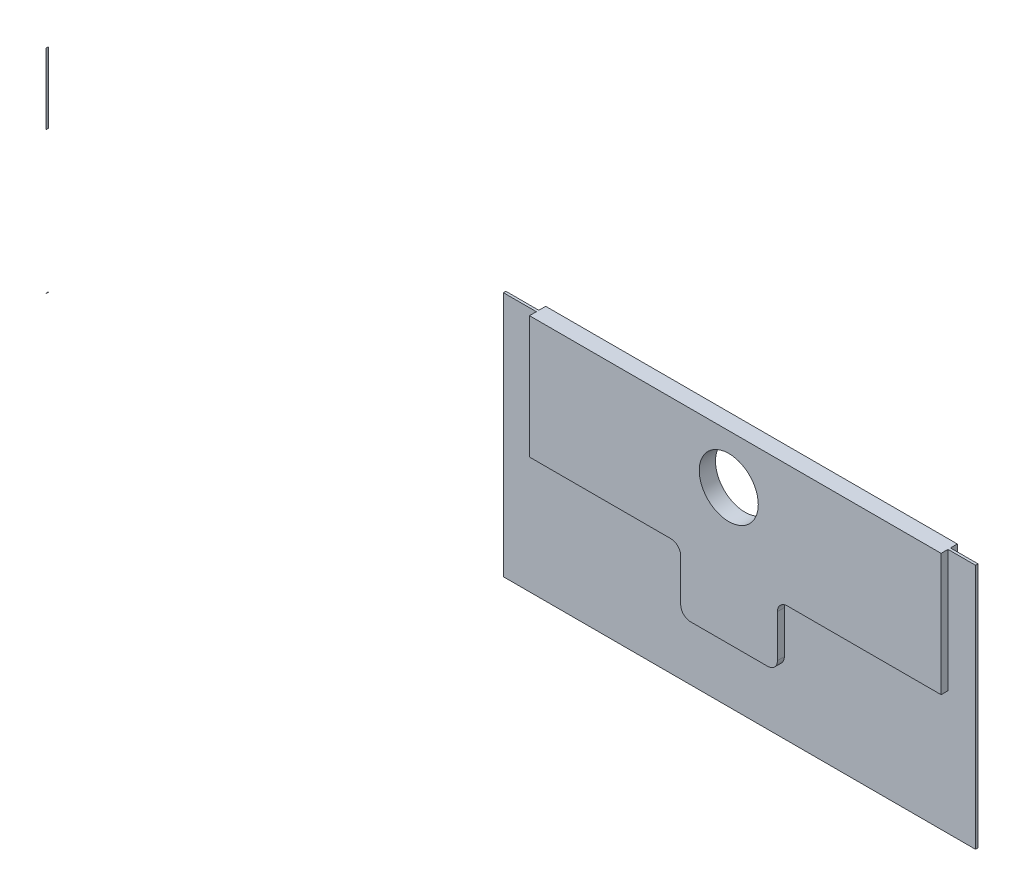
from build123d import *
from build123d.topology import SkipClean

# Parameters (mm, degrees)
SKETCH1_R                = 0.3175
SKETCH1_R_2              = 0.508
SKETCH1_R_3              = 1.524
SKETCH1_R_4              = 3.556
BOSS_EXTRUDE1_DEPTH      = 0.127
BOSS_EXTRUDE2_START      = 0.0508
SKETCH2_R                = 0.6985
SKETCH2_R_2              = 0.3175
BOSS_EXTRUDE2_DEPTH      = 0.0508
SKETCH3_R                = 0.6985
SKETCH3_R_2              = 0.3175
BOSS_EXTRUDE3_DEPTH      = 0.0508
BOSS_EXTRUDE4_START      = 0.0508
SKETCH4_R                = 1.27
SKETCH4_R_2              = 0.508
BOSS_EXTRUDE4_DEPTH      = 0.0508
SKETCH5_R                = 1.27
SKETCH5_R_2              = 0.508
BOSS_EXTRUDE5_DEPTH      = 0.0508
BOSS_EXTRUDE6_DEPTH      = 0.3556
BOSS_EXTRUDE6_DEPTH_BACK = 0.4826
SKETCH6_R                = 3.556
SKETCH6_R_2              = 1.524
BOSS_EXTRUDE8_START      = 0.3556
SKETCH9_R                = 1.524
BOSS_EXTRUDE8_DEPTH      = 0.3556
BOSS_EXTRUDE9_START      = 0.3556
SKETCH10_R               = 1.524
BOSS_EXTRUDE9_DEPTH      = 0.3556
BOSS_EXTRUDE10_START     = 0.3556
SKETCH11_R               = 5.2197
SKETCH11_R_2             = 3.556
SKETCH11_R_3             = 1.524
BOSS_EXTRUDE10_DEPTH     = 0.3556
SKETCH12_W               = 21.2598
SKETCH12_H               = 12.707452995
SKETCH12_R               = 1.524
BOSS_EXTRUDE11_DEPTH     = 0.3556
SKETCH13_W               = 21.2852
SKETCH13_H               = 12.707452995
SKETCH13_R               = 1.524
BOSS_EXTRUDE12_DEPTH     = 0.3556
SKETCH14_R               = 1.778
SKETCH14_R_2             = 1.524
SKETCH14_R_3             = 3.556
SKETCH14_R_4             = 5.2197
BOSS_EXTRUDE13_DEPTH     = 0.3556
BOSS_EXTRUDE17_DEPTH     = 0.0508
SKETCH18_W               = 1.099038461
SKETCH18_H               = 0.529166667
BOSS_EXTRUDE19_DEPTH     = 0.0508
SKETCH19_W               = 23.622
SKETCH19_H               = 19.360223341
CUT_EXTRUDE2_DEPTH       = 384.062358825
SKETCH19_2_W             = 23.622
SKETCH19_2_H             = 19.360223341
CUT_EXTRUDE3_DEPTH       = 2.54
SKETCH20_W               = 76.5741445
SKETCH20_H               = 30.113427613
CUT_EXTRUDE4_DEPTH       = 2.54


with BuildPart() as part:
    # Sketch1 → Boss-Extrude1 (new body)
    with BuildSketch(Plane.XY.offset(0.39116)):
        Polygon((156.11155468, 251.50762754), (156.337, 251.47794764), (256.286000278, 251.47794764), (256.286000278, 251.48474214), (256.491552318, 251.45768098), (256.683098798, 251.378339), (256.847581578, 251.25212894), (256.973791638, 251.08764616), (257.053133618, 250.89609968), (257.080194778, 250.69054764), (257.073399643, 247.66794764), (257.062440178, 247.66794764), (257.106087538, 247.3364116), (257.234055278, 247.02746886), (257.437623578, 246.76217348), (257.702918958, 246.55860518), (258.011861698, 246.43063744), (258.343398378, 246.386990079), (268.503400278, 246.397947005), (268.503400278, 246.38698754), (268.834936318, 246.4306349), (269.143879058, 246.55860264), (269.409174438, 246.76217094), (269.612742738, 247.02746632), (269.740710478, 247.33640906), (269.784357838, 247.6679451), (269.773400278, 250.63974764), (269.766166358, 250.63974764), (269.794975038, 250.85856102), (269.879432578, 251.0624646), (270.013788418, 251.2375595), (270.188883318, 251.37191534), (270.392786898, 251.45637288), (270.611600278, 251.48518156), (271.018000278, 251.47794764), (271.018000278, 251.46794258), (271.730094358, 251.50793234), (272.433234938, 251.62740124), (273.118577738, 251.8248456), (273.777501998, 252.0977813), (274.401727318, 252.4427768), (274.983397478, 252.85549632), (275.515202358, 253.33074556), (275.990451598, 253.86255044), (276.403171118, 254.4442206), (276.748166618, 255.06844592), (277.021102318, 255.72737018), (277.218546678, 256.41271298), (277.338015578, 257.11585356), (277.378005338, 257.82794764), (277.337522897, 258.536938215), (277.21811535, 259.240089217), (277.020730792, 259.925449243), (276.747852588, 260.584397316), (276.402911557, 261.208652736), (275.990242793, 261.790358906), (275.515039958, 262.322205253), (274.983276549, 262.797500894), (274.401642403, 263.210271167), (273.777447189, 263.555321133), (273.118546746, 263.828314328), (272.433221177, 264.025818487), (271.730091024, 264.14534874), (271.018000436, 264.185400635), (156.3624, 264.185400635), (156.3624, 264.19307334), (156.13032528, 264.16251968), (155.9140646, 264.0729415), (155.72835758, 263.93044496), (155.58586104, 263.74473794), (155.49628286, 263.52847726), (155.4657292, 263.296401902), (155.4734, 252.349), (155.46594764, 252.349), (155.49562754, 252.12355468), (155.5826454, 251.91347382), (155.72107286, 251.73307286), (155.90147382, 251.5946454), align=None)
        with Locations(Location((269.24, 259.7658, 0), (0, 0, 180))):
            Circle(SKETCH1_R, mode=Mode.SUBTRACT)
        with Locations(Location((270.9164, 258.8006, 0), (0, 0, 180))):
            Circle(SKETCH1_R, mode=Mode.SUBTRACT)
        with Locations(Location((267.5636, 258.8006, 0), (0, 0, 180))):
            Circle(SKETCH1_R, mode=Mode.SUBTRACT)
        with Locations(Location((269.24, 257.8354, 0), (0, 0, 180))):
            Circle(SKETCH1_R, mode=Mode.SUBTRACT)
        with Locations(Location((270.9164, 256.8702, 0), (0, 0, 180))):
            Circle(SKETCH1_R, mode=Mode.SUBTRACT)
        with Locations(Location((269.24, 255.905, 0), (0, 0, 180))):
            Circle(SKETCH1_R, mode=Mode.SUBTRACT)
        with Locations(Location((267.5636, 256.8702, 0), (0, 0, 180))):
            Circle(SKETCH1_R, mode=Mode.SUBTRACT)
        with Locations(Location((265.9634, 248.9454, 0), (0, 0, 180))):
            Circle(SKETCH1_R_2, mode=Mode.SUBTRACT)
        with Locations(Location((215.6714, 261.6454, 0), (0, 0, 180))):
            Circle(SKETCH1_R_3, mode=Mode.SUBTRACT)
        with Locations(Location((235.077, 261.6454, 0), (0, 0, 180))):
            Circle(SKETCH1_R_3, mode=Mode.SUBTRACT)
        with Locations(Location((171.704, 261.6454, 0), (0, 0, 180))):
            Circle(SKETCH1_R_3, mode=Mode.SUBTRACT)
        with Locations(Location((191.0842, 261.6454, 0), (0, 0, 180))):
            Circle(SKETCH1_R_3, mode=Mode.SUBTRACT)
        with Locations(Location((244.9068, 257.8354, 0), (0, 0, 180))):
            Circle(SKETCH1_R_4, mode=Mode.SUBTRACT)
        with Locations(Location((260.8834, 248.9454, 0), (0, 0, 180))):
            Circle(SKETCH1_R_2, mode=Mode.SUBTRACT)
        with Locations(Location((161.8742, 257.8354, 0), (0, 0, 180))):
            Circle(SKETCH1_R_4, mode=Mode.SUBTRACT)
    extrude(amount=-BOSS_EXTRUDE1_DEPTH)

    # Sketch2 → Boss-Extrude2 (add)
    # profile 1 of 7: a face of its own
    with BuildSketch(Plane.XY.offset(0.39116).offset(BOSS_EXTRUDE2_START)):
        with Locations((269.24, 259.7658)):
            Circle(SKETCH2_R)
        with Locations((269.24, 259.7658)):
            Circle(SKETCH2_R_2, mode=Mode.SUBTRACT)
    # profile 2 of 7: a face of its own
    with BuildSketch(Plane.XY.offset(0.39116).offset(BOSS_EXTRUDE2_START)):
        with Locations((270.9164, 258.8006)):
            Circle(SKETCH2_R)
        with Locations((270.9164, 258.8006)):
            Circle(SKETCH2_R_2, mode=Mode.SUBTRACT)
    # profile 3 of 7: a face of its own
    with BuildSketch(Plane.XY.offset(0.39116).offset(BOSS_EXTRUDE2_START)):
        with Locations((270.9164, 256.8702)):
            Circle(SKETCH2_R)
        with Locations((270.9164, 256.8702)):
            Circle(SKETCH2_R_2, mode=Mode.SUBTRACT)
    # profile 4 of 7: a face of its own
    with BuildSketch(Plane.XY.offset(0.39116).offset(BOSS_EXTRUDE2_START)):
        with Locations((269.24, 255.905)):
            Circle(SKETCH2_R)
        with Locations((269.24, 255.905)):
            Circle(SKETCH2_R_2, mode=Mode.SUBTRACT)
    # profile 5 of 7: a face of its own
    with BuildSketch(Plane.XY.offset(0.39116).offset(BOSS_EXTRUDE2_START)):
        with Locations((269.24, 257.8354)):
            Circle(SKETCH2_R)
        with Locations((269.24, 257.8354)):
            Circle(SKETCH2_R_2, mode=Mode.SUBTRACT)
    # profile 6 of 7: a face of its own
    with BuildSketch(Plane.XY.offset(0.39116).offset(BOSS_EXTRUDE2_START)):
        with Locations((267.5636, 256.8702)):
            Circle(SKETCH2_R)
        with Locations((267.5636, 256.8702)):
            Circle(SKETCH2_R_2, mode=Mode.SUBTRACT)
    # profile 7 of 7: a face of its own
    with BuildSketch(Plane.XY.offset(0.39116).offset(BOSS_EXTRUDE2_START)):
        with Locations((267.5636, 258.8006)):
            Circle(SKETCH2_R)
        with Locations((267.5636, 258.8006)):
            Circle(SKETCH2_R_2, mode=Mode.SUBTRACT)
    extrude(amount=-BOSS_EXTRUDE2_DEPTH)

    # Sketch3 → Boss-Extrude3 (add)
    # profile 1 of 7: a face of its own
    with BuildSketch(Plane.XY.offset(0.26416)):
        with Locations((269.24, 259.7658)):
            Circle(SKETCH3_R)
        with Locations((269.24, 259.7658)):
            Circle(SKETCH3_R_2, mode=Mode.SUBTRACT)
    # profile 2 of 7: a face of its own
    with BuildSketch(Plane.XY.offset(0.26416)):
        with Locations((267.5636, 258.8006)):
            Circle(SKETCH3_R)
        with Locations((267.5636, 258.8006)):
            Circle(SKETCH3_R_2, mode=Mode.SUBTRACT)
    # profile 3 of 7: a face of its own
    with BuildSketch(Plane.XY.offset(0.26416)):
        with Locations((267.5636, 256.8702)):
            Circle(SKETCH3_R)
        with Locations((267.5636, 256.8702)):
            Circle(SKETCH3_R_2, mode=Mode.SUBTRACT)
    # profile 4 of 7: a face of its own
    with BuildSketch(Plane.XY.offset(0.26416)):
        with Locations((269.24, 255.905)):
            Circle(SKETCH3_R)
        with Locations((269.24, 255.905)):
            Circle(SKETCH3_R_2, mode=Mode.SUBTRACT)
    # profile 5 of 7: a face of its own
    with BuildSketch(Plane.XY.offset(0.26416)):
        with Locations((269.24, 257.8354)):
            Circle(SKETCH3_R)
        with Locations((269.24, 257.8354)):
            Circle(SKETCH3_R_2, mode=Mode.SUBTRACT)
    # profile 6 of 7: a face of its own
    with BuildSketch(Plane.XY.offset(0.26416)):
        with Locations((270.9164, 258.8006)):
            Circle(SKETCH3_R)
        with Locations((270.9164, 258.8006)):
            Circle(SKETCH3_R_2, mode=Mode.SUBTRACT)
    # profile 7 of 7: a face of its own
    with BuildSketch(Plane.XY.offset(0.26416)):
        with Locations((270.9164, 256.8702)):
            Circle(SKETCH3_R)
        with Locations((270.9164, 256.8702)):
            Circle(SKETCH3_R_2, mode=Mode.SUBTRACT)
    extrude(amount=-BOSS_EXTRUDE3_DEPTH)

    # Sketch4 → Boss-Extrude4 (add)
    # profile 1 of 2: a face of its own
    with BuildSketch(Plane.XY.offset(0.39116).offset(BOSS_EXTRUDE4_START)):
        with Locations((260.8834, 248.9454)):
            Circle(SKETCH4_R)
        with Locations((260.8834, 248.9454)):
            Circle(SKETCH4_R_2, mode=Mode.SUBTRACT)
    # profile 2 of 2: a face of its own
    with BuildSketch(Plane.XY.offset(0.39116).offset(BOSS_EXTRUDE4_START)):
        with Locations((265.9634, 248.9454)):
            Circle(SKETCH4_R)
        with Locations((265.9634, 248.9454)):
            Circle(SKETCH4_R_2, mode=Mode.SUBTRACT)
    extrude(amount=-BOSS_EXTRUDE4_DEPTH)

    # Sketch5 → Boss-Extrude5 (add)
    # profile 1 of 2: a face of its own
    with BuildSketch(Plane.XY.offset(0.26416)):
        with Locations((265.9634, 248.9454)):
            Circle(SKETCH5_R)
        with Locations((265.9634, 248.9454)):
            Circle(SKETCH5_R_2, mode=Mode.SUBTRACT)
    # profile 2 of 2: a face of its own
    with BuildSketch(Plane.XY.offset(0.26416)):
        with Locations((260.8834, 248.9454)):
            Circle(SKETCH5_R)
        with Locations((260.8834, 248.9454)):
            Circle(SKETCH5_R_2, mode=Mode.SUBTRACT)
    extrude(amount=-BOSS_EXTRUDE5_DEPTH)

    # Sketch6 → Boss-Extrude6 (add, two sides: drawn at the far end of the back side and taken through both)
    with SkipClean():  # the faces are left unmerged after this step: merging them gives an invalid solid
        with BuildSketch(Plane.XY.offset(0.39116).offset(-BOSS_EXTRUDE6_DEPTH_BACK)):
            with BuildLine():
                Line((177.79487504, 251.47794764), (177.79487504, 264.185402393))
                Line((177.79487504, 264.185402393), (156.3624, 264.185400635))
                ThreePointArc((156.3624, 264.185400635), (155.739568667, 263.929838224), (155.46827504, 263.313696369))
                Line((155.46827504, 263.313696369), (155.46827504, 252.300953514))
                ThreePointArc((155.46827504, 252.300953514), (155.743741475, 251.721727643), (156.337, 251.47794764))
                Line((156.337, 251.47794764), (177.79487504, 251.47794764))
            make_face()
            with Locations((161.8742, 257.8354)):
                Circle(SKETCH6_R, mode=Mode.SUBTRACT)
            with Locations((171.704, 261.6454)):
                Circle(SKETCH6_R_2, mode=Mode.SUBTRACT)
        extrude(amount=BOSS_EXTRUDE6_DEPTH + BOSS_EXTRUDE6_DEPTH_BACK)

    # Sketch9 → Boss-Extrude8 (add)
    with SkipClean():  # the faces are left unmerged after this step: merging them gives an invalid solid
        with BuildSketch(Plane.XY.offset(0.39116).offset(BOSS_EXTRUDE8_START)):
            with BuildLine():
                ThreePointArc((188.602516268, 257.353947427), (188.453726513, 257.713157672), (188.094516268, 257.861947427))
                Line((188.094516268, 257.861947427), (180.79207504, 257.861947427))
                Line((180.79207504, 257.861947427), (180.79207504, 264.18540068))
                Line((180.79207504, 264.18540068), (202.05187504, 264.185401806))
                Line((202.05187504, 264.185401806), (202.05187504, 257.861947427))
                Line((202.05187504, 257.861947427), (194.107504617, 257.861947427))
                ThreePointArc((194.107504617, 257.861947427), (193.748294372, 257.713157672), (193.599504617, 257.353947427))
                Line((193.599504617, 257.353947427), (193.599504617, 255.16094764))
                ThreePointArc((193.599504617, 255.16094764), (193.450714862, 254.801737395), (193.091504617, 254.65294764))
                Line((193.091504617, 254.65294764), (189.110516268, 254.65294764))
                ThreePointArc((189.110516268, 254.65294764), (188.751306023, 254.801737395), (188.602516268, 255.16094764))
                Line((188.602516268, 255.16094764), (188.602516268, 257.353947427))
            make_face()
            with Locations((191.0842, 261.6454)):
                Circle(SKETCH9_R, mode=Mode.SUBTRACT)
        extrude(amount=-BOSS_EXTRUDE8_DEPTH)

    # Sketch10 → Boss-Extrude9 (add)
    with SkipClean():  # the faces are left unmerged after this step: merging them gives an invalid solid
        with BuildSketch(Plane.XY.offset(0.39116).offset(BOSS_EXTRUDE9_START)):
            with BuildLine():
                ThreePointArc((213.098791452, 257.353947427), (212.950001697, 257.713157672), (212.590791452, 257.861947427))
                Line((212.590791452, 257.861947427), (204.99827504, 257.861947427))
                Line((204.99827504, 257.861947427), (204.99827504, 264.185400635))
                Line((204.99827504, 264.185400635), (226.28347504, 264.185400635))
                Line((226.28347504, 264.185400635), (226.28347504, 257.861947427))
                Line((226.28347504, 257.861947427), (218.650909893, 257.861947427))
                ThreePointArc((218.650909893, 257.861947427), (218.291699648, 257.713157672), (218.142909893, 257.353947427))
                Line((218.142909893, 257.353947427), (218.142909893, 255.16094764))
                ThreePointArc((218.142909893, 255.16094764), (217.994120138, 254.801737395), (217.634909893, 254.65294764))
                Line((217.634909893, 254.65294764), (213.606791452, 254.65294764))
                ThreePointArc((213.606791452, 254.65294764), (213.247581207, 254.801737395), (213.098791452, 255.16094764))
                Line((213.098791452, 255.16094764), (213.098791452, 257.353947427))
            make_face()
            with Locations((215.6714, 261.6454)):
                Circle(SKETCH10_R, mode=Mode.SUBTRACT)
        extrude(amount=-BOSS_EXTRUDE9_DEPTH)

    # Sketch11 → Boss-Extrude10 (add)
    with SkipClean():  # the faces are left unmerged after this step: merging them gives an invalid solid
        with BuildSketch(Plane.XY.offset(0.39116).offset(BOSS_EXTRUDE10_START)):
            with BuildLine():
                ThreePointArc((271.730091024, 264.14534874), (277.367721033, 257.826642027), (271.730094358, 251.50793234))
                Line((271.730094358, 251.50793234), (229.22987504, 251.478351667))
                Line((229.22987504, 251.478351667), (229.22987504, 264.184362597))
                Line((229.22987504, 264.184362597), (271.730091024, 264.14534874))
            make_face()
            with Locations((269.24, 257.8354)):
                Circle(SKETCH11_R, mode=Mode.SUBTRACT)
            with Locations((244.9068, 257.8354)):
                Circle(SKETCH11_R_2, mode=Mode.SUBTRACT)
            with Locations((235.077, 261.6454)):
                Circle(SKETCH11_R_3, mode=Mode.SUBTRACT)
        extrude(amount=-BOSS_EXTRUDE10_DEPTH)

    # Sketch12 → Boss-Extrude11 (add)
    with SkipClean():  # the faces are left unmerged after this step: merging them gives an invalid solid
        with BuildSketch(Plane(origin=(0, 0, 0.26416), x_dir=(-1, 0, 0), z_dir=(0, 0, -1))):
            with Locations((-191.42197504, 257.831674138)):
                Rectangle(SKETCH12_W, SKETCH12_H)
            with Locations(Location((-191.0842, 261.6454, 0), (0, 0, 180))):
                Circle(SKETCH12_R, mode=Mode.SUBTRACT)
        extrude(amount=BOSS_EXTRUDE11_DEPTH)

    # Sketch13 → Boss-Extrude12 (add)
    with SkipClean():  # the faces are left unmerged after this step: merging them gives an invalid solid
        with BuildSketch(Plane(origin=(0, 0, 0.26416), x_dir=(-1, 0, 0), z_dir=(0, 0, -1))):
            with Locations((-215.64087504, 257.831674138)):
                Rectangle(SKETCH13_W, SKETCH13_H)
            with Locations((-215.6714, 261.6454)):
                Circle(SKETCH13_R, mode=Mode.SUBTRACT)
        extrude(amount=BOSS_EXTRUDE12_DEPTH)

    # Sketch14 → Boss-Extrude13 (add)
    with SkipClean():  # the faces are left unmerged after this step: merging them gives an invalid solid
        with BuildSketch(Plane(origin=(0, 0, 0.26416), x_dir=(-1, 0, 0), z_dir=(0, 0, -1))):
            with BuildLine():
                Line((-271.015154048, 251.477947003), (-270.605817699, 251.477947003))
                ThreePointArc((-270.605817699, 251.477947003), (-270.016863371, 251.23040133), (-269.773400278, 250.63974764))
                Line((-269.773400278, 250.63974764), (-269.784357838, 247.6679451))
                ThreePointArc((-269.784357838, 247.6679451), (-269.410770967, 246.763750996), (-268.503400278, 246.397947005))
                Line((-268.503400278, 246.397947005), (-258.343398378, 246.386990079))
                ThreePointArc((-258.343398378, 246.386990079), (-257.445612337, 246.770161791), (-257.062440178, 247.66794764))
                Line((-257.062440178, 247.66794764), (-257.080194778, 250.69054764))
                ThreePointArc((-257.080194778, 250.69054764), (-256.844162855, 251.246702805), (-256.286000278, 251.47794764))
                Line((-256.286000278, 251.47794764), (-229.22987504, 251.47794764))
                Line((-229.22987504, 251.47794764), (-229.22987504, 264.184362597))
                Line((-229.22987504, 264.184362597), (-271.730091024, 264.14534874))
                ThreePointArc((-271.730091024, 264.14534874), (-277.358934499, 257.473785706), (-271.015154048, 251.477947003))
            make_face()
            with Locations((-260.8834, 248.9454)):
                Circle(SKETCH14_R, mode=Mode.SUBTRACT)
            with Locations((-265.9634, 248.9454)):
                Circle(SKETCH14_R, mode=Mode.SUBTRACT)
            with Locations((-235.077, 261.6454)):
                Circle(SKETCH14_R_2, mode=Mode.SUBTRACT)
            with Locations((-244.9068, 257.8354)):
                Circle(SKETCH14_R_3, mode=Mode.SUBTRACT)
            with Locations((-269.24, 257.8354)):
                Circle(SKETCH14_R_4, mode=Mode.SUBTRACT)
        extrude(amount=BOSS_EXTRUDE13_DEPTH)

    # Sketch17 → Boss-Extrude17 (add)
    with SkipClean():  # the faces are left unmerged after this step: merging them gives an invalid solid
        with BuildSketch(Plane(origin=(0, 0, 0.26416), x_dir=(-1, 0, 0), z_dir=(0, 0, -1))):
            with BuildLine():
                Line((-267.284159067, 258.170767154), (-265.332275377, 258.166685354))
                Line((-265.332275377, 258.166685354), (-261.5184, 254.422244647))
                Line((-261.5184, 254.422244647), (-261.5184, 250.045888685))
                ThreePointArc((-261.5184, 250.045888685), (-260.883385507, 250.074491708), (-260.2484, 250.045252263))
                Line((-260.2484, 250.045252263), (-260.2484, 254.955143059))
                Line((-260.2484, 254.955143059), (-264.811939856, 259.4356))
                Line((-264.811939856, 259.4356), (-267.284163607, 259.44076994))
                ThreePointArc((-267.284163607, 259.44076994), (-266.982140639, 258.805769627), (-267.284159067, 258.170767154))
            make_face()
            with BuildLine():
                Line((-267.284150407, 256.230035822), (-266.701334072, 256.230676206))
                Line((-266.701334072, 256.230676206), (-266.5984, 256.146143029))
                Line((-266.5984, 256.146143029), (-266.5984, 250.045243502))
                ThreePointArc((-266.5984, 250.045243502), (-265.963400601, 250.13231716), (-265.3284, 250.045252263))
                Line((-265.3284, 250.045252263), (-265.3284, 256.746549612))
                Line((-265.3284, 256.746549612), (-266.247290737, 257.501175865))
                Line((-266.247290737, 257.501175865), (-267.284165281, 257.500036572))
                ThreePointArc((-267.284165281, 257.500036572), (-266.919694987, 256.865040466), (-267.284150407, 256.230035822))
            make_face()
        extrude(amount=BOSS_EXTRUDE17_DEPTH)

    # Sketch18 → Boss-Extrude19 (add)
    with SkipClean():  # the faces are left unmerged after this step: merging them gives an invalid solid
        with BuildSketch(Plane.XY.offset(0.39116)):
            Polygon((258.287631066, 250.186779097), (258.287631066, 250.960176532), (258.816797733, 250.960176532), (258.816797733, 250.186779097), (259.630900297, 250.186779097), (259.630900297, 249.65761243), (258.816797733, 249.65761243), (258.816797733, 248.884214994), (258.287631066, 248.884214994), (258.287631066, 249.65761243), (257.473528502, 249.65761243), (257.473528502, 250.186779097), align=None)
            with Locations((268.117919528, 249.55584961)):
                Rectangle(SKETCH18_W, SKETCH18_H)
        extrude(amount=BOSS_EXTRUDE19_DEPTH)

    # Sketch19 → Cut-Extrude2 (cut, through all)
    with SkipClean():  # the faces are left unmerged after this step: merging them gives an invalid solid
        with BuildSketch(Plane.XY.offset(0.39116)):
            with Locations((167.27927504, 257.888990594)):
                Rectangle(SKETCH19_W, SKETCH19_H)
        extrude(amount=CUT_EXTRUDE2_DEPTH, mode=Mode.SUBTRACT)

    # Sketch19_2 → Cut-Extrude3 (cut)
    with BuildSketch(Plane.XY.offset(0.39116)):
        with Locations((167.27927504, 257.888990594)):
            Rectangle(SKETCH19_2_W, SKETCH19_2_H)
    extrude(amount=-CUT_EXTRUDE3_DEPTH, mode=Mode.SUBTRACT)


with BuildPart() as cut_extrude3_piece_1:
    # of the separate pieces the step leaves, piece 1, a body of its own (cut_extrude3_pieces)
    add(part.part.solids().sort_by_distance((188.602516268, 257.353947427, 0.39116))[0])

    # Sketch20 → Cut-Extrude4 (cut)
    with BuildSketch(Plane.XY.offset(0.74676)):
        with Locations((241.76134729, 252.368215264)):
            Rectangle(SKETCH20_W, SKETCH20_H)
    extrude(amount=-CUT_EXTRUDE4_DEPTH, mode=Mode.SUBTRACT)


with BuildPart() as cut_extrude3_piece_2:
    # of the separate pieces the step leaves, piece 2, a body of its own (cut_extrude3_pieces)
    add(part.part.solids().sort_by_distance((155.46827504, 259.66309944, 0.39116))[0])


with BuildPart() as cut_extrude3_piece_3:
    # of the separate pieces the step leaves, piece 3, a body of its own (cut_extrude3_pieces)
    add(part.part.solids().sort_by_distance((155.46594764, 252.349, 0.39116))[0])


solid = Compound([cut_extrude3_piece_1.part, cut_extrude3_piece_2.part, cut_extrude3_piece_3.part])
